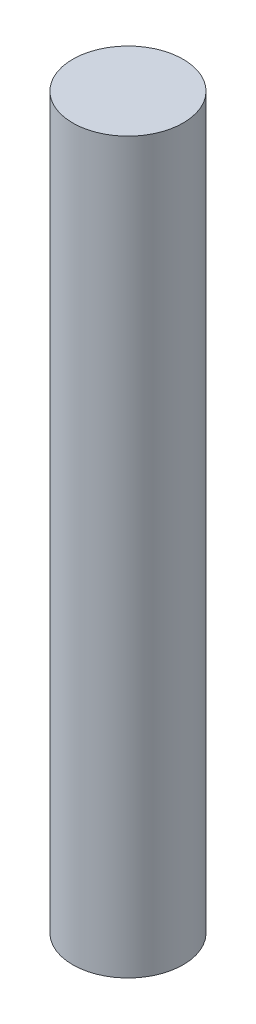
ISO-10303-21;
HEADER;
FILE_DESCRIPTION(('STEP AP214'),'2;1');
FILE_NAME('part.step','',(''),(''),'','','');
FILE_SCHEMA(('AUTOMOTIVE_DESIGN { 1 0 10303 214 1 1 1 1 }'));
ENDSEC;
DATA;
#1=APPLICATION_CONTEXT('core data for automotive mechanical design processes');
#2=APPLICATION_PROTOCOL_DEFINITION('international standard','automotive_design',2000,#1);
#3=PRODUCT_CONTEXT('',#1,'mechanical');
#4=PRODUCT('Part','Part','',(#3));
#5=PRODUCT_RELATED_PRODUCT_CATEGORY('part','',(#4));
#6=PRODUCT_DEFINITION_FORMATION('','',#4);
#7=PRODUCT_DEFINITION_CONTEXT('part definition',#1,'design');
#8=PRODUCT_DEFINITION('design','',#6,#7);
#9=PRODUCT_DEFINITION_SHAPE('','',#8);
#10=(LENGTH_UNIT() NAMED_UNIT(*) SI_UNIT(.MILLI.,.METRE.));
#11=(NAMED_UNIT(*) PLANE_ANGLE_UNIT() SI_UNIT($,.RADIAN.));
#12=(NAMED_UNIT(*) SI_UNIT($,.STERADIAN.) SOLID_ANGLE_UNIT());
#13=UNCERTAINTY_MEASURE_WITH_UNIT(LENGTH_MEASURE(1.E-05),#10,'distance_accuracy_value','');
#14=(GEOMETRIC_REPRESENTATION_CONTEXT(3) GLOBAL_UNCERTAINTY_ASSIGNED_CONTEXT((#13)) GLOBAL_UNIT_ASSIGNED_CONTEXT((#10,
#11,#12)) REPRESENTATION_CONTEXT('',''));
#15=CARTESIAN_POINT('',(0.,0.,0.));
#16=DIRECTION('',(0.,0.,1.));
#17=DIRECTION('',(1.,0.,0.));
#18=AXIS2_PLACEMENT_3D('',#15,#16,#17);
#19=CARTESIAN_POINT('',(0.,33.,0.));
#20=DIRECTION('',(0.,-1.,0.));
#21=DIRECTION('',(0.,0.,-1.));
#22=AXIS2_PLACEMENT_3D('',#19,#20,#21);
#23=CYLINDRICAL_SURFACE('',#22,2.5);
#24=CARTESIAN_POINT('',(0.,33.,0.));
#25=DIRECTION('',(0.,1.,0.));
#26=DIRECTION('',(0.,0.,1.));
#27=AXIS2_PLACEMENT_3D('',#24,#25,#26);
#28=CIRCLE('',#27,2.5);
#29=CARTESIAN_POINT('',(0.,33.,2.5));
#30=VERTEX_POINT('',#29);
#31=EDGE_CURVE('E10',#30,#30,#28,.T.);
#32=ORIENTED_EDGE('',*,*,#31,.F.);
#33=EDGE_LOOP('',(#32));
#34=FACE_BOUND('',#33,.T.);
#35=CARTESIAN_POINT('',(0.,0.,0.));
#36=DIRECTION('',(0.,1.,0.));
#37=DIRECTION('',(0.,0.,1.));
#38=AXIS2_PLACEMENT_3D('',#35,#36,#37);
#39=CIRCLE('',#38,2.5);
#40=CARTESIAN_POINT('',(0.,0.,2.5));
#41=VERTEX_POINT('',#40);
#42=EDGE_CURVE('E33',#41,#41,#39,.T.);
#43=ORIENTED_EDGE('',*,*,#42,.T.);
#44=EDGE_LOOP('',(#43));
#45=FACE_BOUND('',#44,.T.);
#46=ADVANCED_FACE('F30',(#34,#45),#23,.T.);
#47=CARTESIAN_POINT('',(0.,33.,0.));
#48=DIRECTION('',(0.,1.,0.));
#49=DIRECTION('',(0.,0.,1.));
#50=AXIS2_PLACEMENT_3D('',#47,#48,#49);
#51=PLANE('',#50);
#52=ORIENTED_EDGE('',*,*,#31,.T.);
#53=EDGE_LOOP('',(#52));
#54=FACE_BOUND('',#53,.T.);
#55=ADVANCED_FACE('F45',(#54),#51,.T.);
#56=CARTESIAN_POINT('',(0.,0.,0.));
#57=DIRECTION('',(0.,1.,0.));
#58=DIRECTION('',(0.,0.,1.));
#59=AXIS2_PLACEMENT_3D('',#56,#57,#58);
#60=PLANE('',#59);
#61=ORIENTED_EDGE('',*,*,#42,.F.);
#62=EDGE_LOOP('',(#61));
#63=FACE_BOUND('',#62,.T.);
#64=ADVANCED_FACE('F43',(#63),#60,.F.);
#65=CLOSED_SHELL('',(#46,#55,#64));
#66=MANIFOLD_SOLID_BREP('B2',#65);
#67=ADVANCED_BREP_SHAPE_REPRESENTATION('',(#18,#66),#14);
#68=SHAPE_DEFINITION_REPRESENTATION(#9,#67);
ENDSEC;
END-ISO-10303-21;
